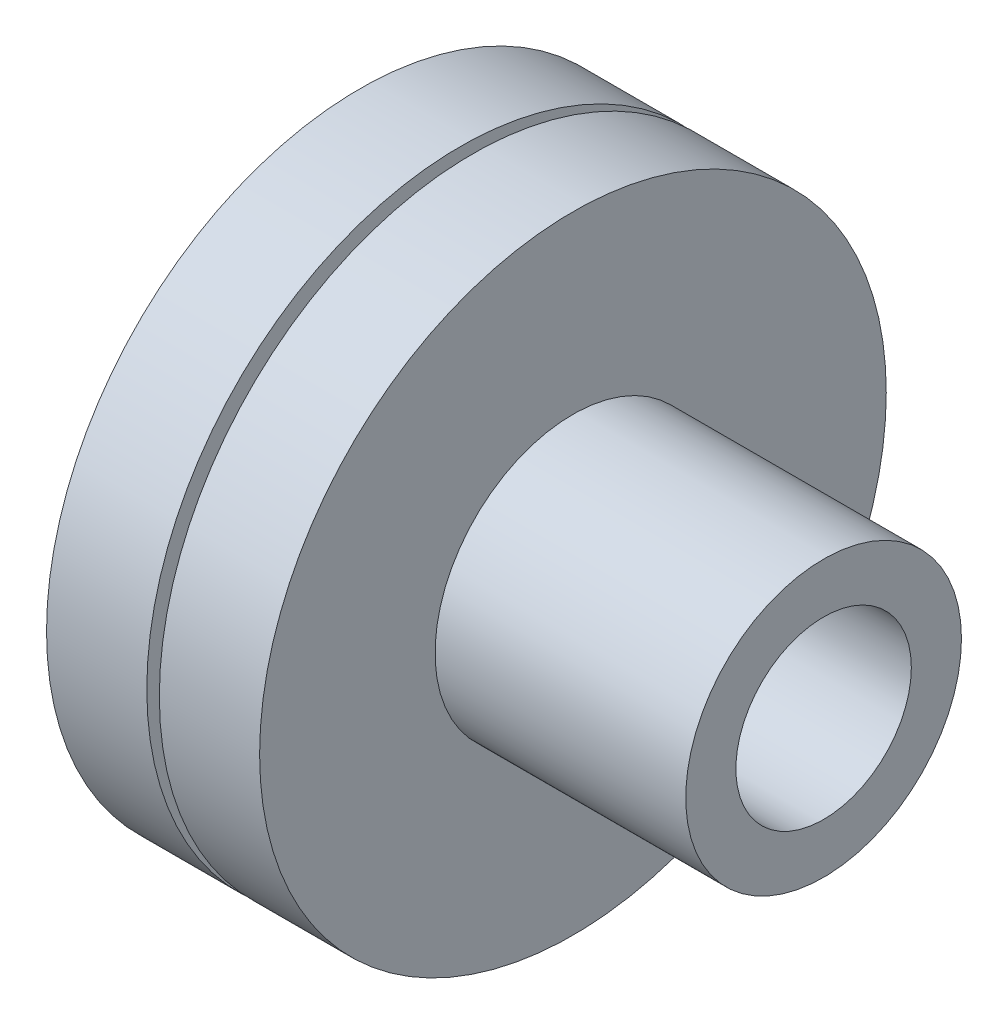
ISO-10303-21;
HEADER;
FILE_DESCRIPTION(('STEP AP214'),'2;1');
FILE_NAME('part.step','',(''),(''),'','','');
FILE_SCHEMA(('AUTOMOTIVE_DESIGN { 1 0 10303 214 1 1 1 1 }'));
ENDSEC;
DATA;
#1=APPLICATION_CONTEXT('core data for automotive mechanical design processes');
#2=APPLICATION_PROTOCOL_DEFINITION('international standard','automotive_design',2000,#1);
#3=PRODUCT_CONTEXT('',#1,'mechanical');
#4=PRODUCT('Part','Part','',(#3));
#5=PRODUCT_RELATED_PRODUCT_CATEGORY('part','',(#4));
#6=PRODUCT_DEFINITION_FORMATION('','',#4);
#7=PRODUCT_DEFINITION_CONTEXT('part definition',#1,'design');
#8=PRODUCT_DEFINITION('design','',#6,#7);
#9=PRODUCT_DEFINITION_SHAPE('','',#8);
#10=(LENGTH_UNIT() NAMED_UNIT(*) SI_UNIT(.MILLI.,.METRE.));
#11=(NAMED_UNIT(*) PLANE_ANGLE_UNIT() SI_UNIT($,.RADIAN.));
#12=(NAMED_UNIT(*) SI_UNIT($,.STERADIAN.) SOLID_ANGLE_UNIT());
#13=UNCERTAINTY_MEASURE_WITH_UNIT(LENGTH_MEASURE(1.E-05),#10,'distance_accuracy_value','');
#14=(GEOMETRIC_REPRESENTATION_CONTEXT(3) GLOBAL_UNCERTAINTY_ASSIGNED_CONTEXT((#13)) GLOBAL_UNIT_ASSIGNED_CONTEXT((#10,
#11,#12)) REPRESENTATION_CONTEXT('',''));
#15=CARTESIAN_POINT('',(0.,0.,0.));
#16=DIRECTION('',(0.,0.,1.));
#17=DIRECTION('',(1.,0.,0.));
#18=AXIS2_PLACEMENT_3D('',#15,#16,#17);
#19=CARTESIAN_POINT('',(0.,0.,0.));
#20=DIRECTION('',(1.,0.,0.));
#21=DIRECTION('',(0.,0.,-1.));
#22=AXIS2_PLACEMENT_3D('',#19,#20,#21);
#23=CYLINDRICAL_SURFACE('',#22,35.);
#24=CARTESIAN_POINT('',(225.,0.,0.));
#25=DIRECTION('',(1.,0.,0.));
#26=DIRECTION('',(0.,0.,-1.));
#27=AXIS2_PLACEMENT_3D('',#24,#25,#26);
#28=CIRCLE('',#27,35.);
#29=CARTESIAN_POINT('',(225.,0.,-35.));
#30=VERTEX_POINT('',#29);
#31=EDGE_CURVE('E60',#30,#30,#28,.T.);
#32=ORIENTED_EDGE('',*,*,#31,.T.);
#33=EDGE_LOOP('',(#32));
#34=FACE_BOUND('',#33,.T.);
#35=CARTESIAN_POINT('',(85.,0.,0.));
#36=DIRECTION('',(1.,0.,0.));
#37=DIRECTION('',(0.,0.,-1.));
#38=AXIS2_PLACEMENT_3D('',#35,#36,#37);
#39=CIRCLE('',#38,35.);
#40=CARTESIAN_POINT('',(85.,0.,-35.));
#41=VERTEX_POINT('',#40);
#42=EDGE_CURVE('E11',#41,#41,#39,.T.);
#43=ORIENTED_EDGE('',*,*,#42,.F.);
#44=EDGE_LOOP('',(#43));
#45=FACE_BOUND('',#44,.T.);
#46=ADVANCED_FACE('F38',(#34,#45),#23,.F.);
#47=CARTESIAN_POINT('',(85.,35.,0.));
#48=DIRECTION('',(-1.,0.,0.));
#49=DIRECTION('',(0.,0.,1.));
#50=AXIS2_PLACEMENT_3D('',#47,#48,#49);
#51=PLANE('',#50);
#52=ORIENTED_EDGE('',*,*,#42,.T.);
#53=EDGE_LOOP('',(#52));
#54=FACE_BOUND('',#53,.T.);
#55=CARTESIAN_POINT('',(85.,0.,0.));
#56=DIRECTION('',(1.,0.,0.));
#57=DIRECTION('',(0.,0.,-1.));
#58=AXIS2_PLACEMENT_3D('',#55,#56,#57);
#59=CIRCLE('',#58,125.);
#60=CARTESIAN_POINT('',(85.,0.,-125.));
#61=VERTEX_POINT('',#60);
#62=EDGE_CURVE('E44',#61,#61,#59,.T.);
#63=ORIENTED_EDGE('',*,*,#62,.F.);
#64=EDGE_LOOP('',(#63));
#65=FACE_BOUND('',#64,.T.);
#66=ADVANCED_FACE('F78',(#54,#65),#51,.T.);
#67=CARTESIAN_POINT('',(0.,0.,0.));
#68=DIRECTION('',(1.,0.,0.));
#69=DIRECTION('',(0.,0.,-1.));
#70=AXIS2_PLACEMENT_3D('',#67,#68,#69);
#71=CYLINDRICAL_SURFACE('',#70,125.);
#72=ORIENTED_EDGE('',*,*,#62,.T.);
#73=EDGE_LOOP('',(#72));
#74=FACE_BOUND('',#73,.T.);
#75=CARTESIAN_POINT('',(125.,0.,0.));
#76=DIRECTION('',(1.,0.,0.));
#77=DIRECTION('',(0.,0.,-1.));
#78=AXIS2_PLACEMENT_3D('',#75,#76,#77);
#79=CIRCLE('',#78,125.);
#80=CARTESIAN_POINT('',(125.,0.,-125.));
#81=VERTEX_POINT('',#80);
#82=EDGE_CURVE('E48',#81,#81,#79,.T.);
#83=ORIENTED_EDGE('',*,*,#82,.F.);
#84=EDGE_LOOP('',(#83));
#85=FACE_BOUND('',#84,.T.);
#86=ADVANCED_FACE('F82',(#74,#85),#71,.T.);
#87=CARTESIAN_POINT('',(125.,125.,0.));
#88=DIRECTION('',(1.,0.,0.));
#89=DIRECTION('',(0.,0.,-1.));
#90=AXIS2_PLACEMENT_3D('',#87,#88,#89);
#91=PLANE('',#90);
#92=ORIENTED_EDGE('',*,*,#82,.T.);
#93=EDGE_LOOP('',(#92));
#94=FACE_BOUND('',#93,.T.);
#95=CARTESIAN_POINT('',(125.,0.,0.));
#96=DIRECTION('',(1.,0.,0.));
#97=DIRECTION('',(0.,0.,-1.));
#98=AXIS2_PLACEMENT_3D('',#95,#96,#97);
#99=CIRCLE('',#98,55.);
#100=CARTESIAN_POINT('',(125.,0.,-55.));
#101=VERTEX_POINT('',#100);
#102=EDGE_CURVE('E52',#101,#101,#99,.T.);
#103=ORIENTED_EDGE('',*,*,#102,.F.);
#104=EDGE_LOOP('',(#103));
#105=FACE_BOUND('',#104,.T.);
#106=ADVANCED_FACE('F74',(#94,#105),#91,.T.);
#107=CARTESIAN_POINT('',(0.,0.,0.));
#108=DIRECTION('',(1.,0.,0.));
#109=DIRECTION('',(0.,0.,-1.));
#110=AXIS2_PLACEMENT_3D('',#107,#108,#109);
#111=CYLINDRICAL_SURFACE('',#110,55.);
#112=ORIENTED_EDGE('',*,*,#102,.T.);
#113=EDGE_LOOP('',(#112));
#114=FACE_BOUND('',#113,.T.);
#115=CARTESIAN_POINT('',(225.,0.,0.));
#116=DIRECTION('',(1.,0.,0.));
#117=DIRECTION('',(0.,0.,-1.));
#118=AXIS2_PLACEMENT_3D('',#115,#116,#117);
#119=CIRCLE('',#118,55.);
#120=CARTESIAN_POINT('',(225.,0.,-55.));
#121=VERTEX_POINT('',#120);
#122=EDGE_CURVE('E57',#121,#121,#119,.T.);
#123=ORIENTED_EDGE('',*,*,#122,.F.);
#124=EDGE_LOOP('',(#123));
#125=FACE_BOUND('',#124,.T.);
#126=ADVANCED_FACE('F68',(#114,#125),#111,.T.);
#127=CARTESIAN_POINT('',(225.,55.,0.));
#128=DIRECTION('',(1.,0.,0.));
#129=DIRECTION('',(0.,0.,-1.));
#130=AXIS2_PLACEMENT_3D('',#127,#128,#129);
#131=PLANE('',#130);
#132=ORIENTED_EDGE('',*,*,#122,.T.);
#133=EDGE_LOOP('',(#132));
#134=FACE_BOUND('',#133,.T.);
#135=ORIENTED_EDGE('',*,*,#31,.F.);
#136=EDGE_LOOP('',(#135));
#137=FACE_BOUND('',#136,.T.);
#138=ADVANCED_FACE('F66',(#134,#137),#131,.T.);
#139=CLOSED_SHELL('',(#46,#66,#86,#106,#126,#138));
#140=MANIFOLD_SOLID_BREP('B2',#139);
#141=CARTESIAN_POINT('',(80.,35.,0.));
#142=DIRECTION('',(1.,0.,0.));
#143=DIRECTION('',(0.,0.,-1.));
#144=AXIS2_PLACEMENT_3D('',#141,#142,#143);
#145=PLANE('',#144);
#146=CARTESIAN_POINT('',(80.,0.,0.));
#147=DIRECTION('',(1.,0.,0.));
#148=DIRECTION('',(0.,0.,-1.));
#149=AXIS2_PLACEMENT_3D('',#146,#147,#148);
#150=CIRCLE('',#149,125.);
#151=CARTESIAN_POINT('',(80.,0.,-125.));
#152=VERTEX_POINT('',#151);
#153=EDGE_CURVE('E37',#152,#152,#150,.T.);
#154=ORIENTED_EDGE('',*,*,#153,.T.);
#155=EDGE_LOOP('',(#154));
#156=FACE_BOUND('',#155,.T.);
#157=CARTESIAN_POINT('',(80.,0.,0.));
#158=DIRECTION('',(1.,0.,0.));
#159=DIRECTION('',(0.,0.,-1.));
#160=AXIS2_PLACEMENT_3D('',#157,#158,#159);
#161=CIRCLE('',#160,35.);
#162=CARTESIAN_POINT('',(80.,0.,-35.));
#163=VERTEX_POINT('',#162);
#164=EDGE_CURVE('E151',#163,#163,#161,.T.);
#165=ORIENTED_EDGE('',*,*,#164,.F.);
#166=EDGE_LOOP('',(#165));
#167=FACE_BOUND('',#166,.T.);
#168=ADVANCED_FACE('F129',(#156,#167),#145,.T.);
#169=CARTESIAN_POINT('',(0.,0.,0.));
#170=DIRECTION('',(1.,0.,0.));
#171=DIRECTION('',(0.,0.,-1.));
#172=AXIS2_PLACEMENT_3D('',#169,#170,#171);
#173=CYLINDRICAL_SURFACE('',#172,125.);
#174=CARTESIAN_POINT('',(40.,0.,0.));
#175=DIRECTION('',(1.,0.,0.));
#176=DIRECTION('',(0.,0.,-1.));
#177=AXIS2_PLACEMENT_3D('',#174,#175,#176);
#178=CIRCLE('',#177,125.);
#179=CARTESIAN_POINT('',(40.,0.,-125.));
#180=VERTEX_POINT('',#179);
#181=EDGE_CURVE('E135',#180,#180,#178,.T.);
#182=ORIENTED_EDGE('',*,*,#181,.T.);
#183=EDGE_LOOP('',(#182));
#184=FACE_BOUND('',#183,.T.);
#185=ORIENTED_EDGE('',*,*,#153,.F.);
#186=EDGE_LOOP('',(#185));
#187=FACE_BOUND('',#186,.T.);
#188=ADVANCED_FACE('F159',(#184,#187),#173,.T.);
#189=CARTESIAN_POINT('',(40.,125.,0.));
#190=DIRECTION('',(-1.,0.,0.));
#191=DIRECTION('',(0.,0.,1.));
#192=AXIS2_PLACEMENT_3D('',#189,#190,#191);
#193=PLANE('',#192);
#194=CARTESIAN_POINT('',(40.,0.,0.));
#195=DIRECTION('',(1.,0.,0.));
#196=DIRECTION('',(0.,0.,-1.));
#197=AXIS2_PLACEMENT_3D('',#194,#195,#196);
#198=CIRCLE('',#197,55.);
#199=CARTESIAN_POINT('',(40.,0.,-55.));
#200=VERTEX_POINT('',#199);
#201=EDGE_CURVE('E139',#200,#200,#198,.T.);
#202=ORIENTED_EDGE('',*,*,#201,.T.);
#203=EDGE_LOOP('',(#202));
#204=FACE_BOUND('',#203,.T.);
#205=ORIENTED_EDGE('',*,*,#181,.F.);
#206=EDGE_LOOP('',(#205));
#207=FACE_BOUND('',#206,.T.);
#208=ADVANCED_FACE('F163',(#204,#207),#193,.T.);
#209=CARTESIAN_POINT('',(0.,0.,0.));
#210=DIRECTION('',(1.,0.,0.));
#211=DIRECTION('',(0.,0.,-1.));
#212=AXIS2_PLACEMENT_3D('',#209,#210,#211);
#213=CYLINDRICAL_SURFACE('',#212,55.);
#214=CARTESIAN_POINT('',(0.,0.,0.));
#215=DIRECTION('',(1.,0.,0.));
#216=DIRECTION('',(0.,0.,-1.));
#217=AXIS2_PLACEMENT_3D('',#214,#215,#216);
#218=CIRCLE('',#217,55.);
#219=CARTESIAN_POINT('',(0.,0.,-55.));
#220=VERTEX_POINT('',#219);
#221=EDGE_CURVE('E143',#220,#220,#218,.T.);
#222=ORIENTED_EDGE('',*,*,#221,.T.);
#223=EDGE_LOOP('',(#222));
#224=FACE_BOUND('',#223,.T.);
#225=ORIENTED_EDGE('',*,*,#201,.F.);
#226=EDGE_LOOP('',(#225));
#227=FACE_BOUND('',#226,.T.);
#228=ADVANCED_FACE('F167',(#224,#227),#213,.T.);
#229=CARTESIAN_POINT('',(0.,55.,0.));
#230=DIRECTION('',(-1.,0.,0.));
#231=DIRECTION('',(0.,0.,1.));
#232=AXIS2_PLACEMENT_3D('',#229,#230,#231);
#233=PLANE('',#232);
#234=CARTESIAN_POINT('',(0.,0.,0.));
#235=DIRECTION('',(1.,0.,0.));
#236=DIRECTION('',(0.,0.,-1.));
#237=AXIS2_PLACEMENT_3D('',#234,#235,#236);
#238=CIRCLE('',#237,35.);
#239=CARTESIAN_POINT('',(0.,0.,-35.));
#240=VERTEX_POINT('',#239);
#241=EDGE_CURVE('E148',#240,#240,#238,.T.);
#242=ORIENTED_EDGE('',*,*,#241,.T.);
#243=EDGE_LOOP('',(#242));
#244=FACE_BOUND('',#243,.T.);
#245=ORIENTED_EDGE('',*,*,#221,.F.);
#246=EDGE_LOOP('',(#245));
#247=FACE_BOUND('',#246,.T.);
#248=ADVANCED_FACE('F174',(#244,#247),#233,.T.);
#249=CARTESIAN_POINT('',(0.,0.,0.));
#250=DIRECTION('',(1.,0.,0.));
#251=DIRECTION('',(0.,0.,-1.));
#252=AXIS2_PLACEMENT_3D('',#249,#250,#251);
#253=CYLINDRICAL_SURFACE('',#252,35.);
#254=ORIENTED_EDGE('',*,*,#164,.T.);
#255=EDGE_LOOP('',(#254));
#256=FACE_BOUND('',#255,.T.);
#257=ORIENTED_EDGE('',*,*,#241,.F.);
#258=EDGE_LOOP('',(#257));
#259=FACE_BOUND('',#258,.T.);
#260=ADVANCED_FACE('F155',(#256,#259),#253,.F.);
#261=CLOSED_SHELL('',(#168,#188,#208,#228,#248,#260));
#262=MANIFOLD_SOLID_BREP('B6',#261);
#263=ADVANCED_BREP_SHAPE_REPRESENTATION('',(#18,#140,#262),#14);
#264=SHAPE_DEFINITION_REPRESENTATION(#9,#263);
ENDSEC;
END-ISO-10303-21;
